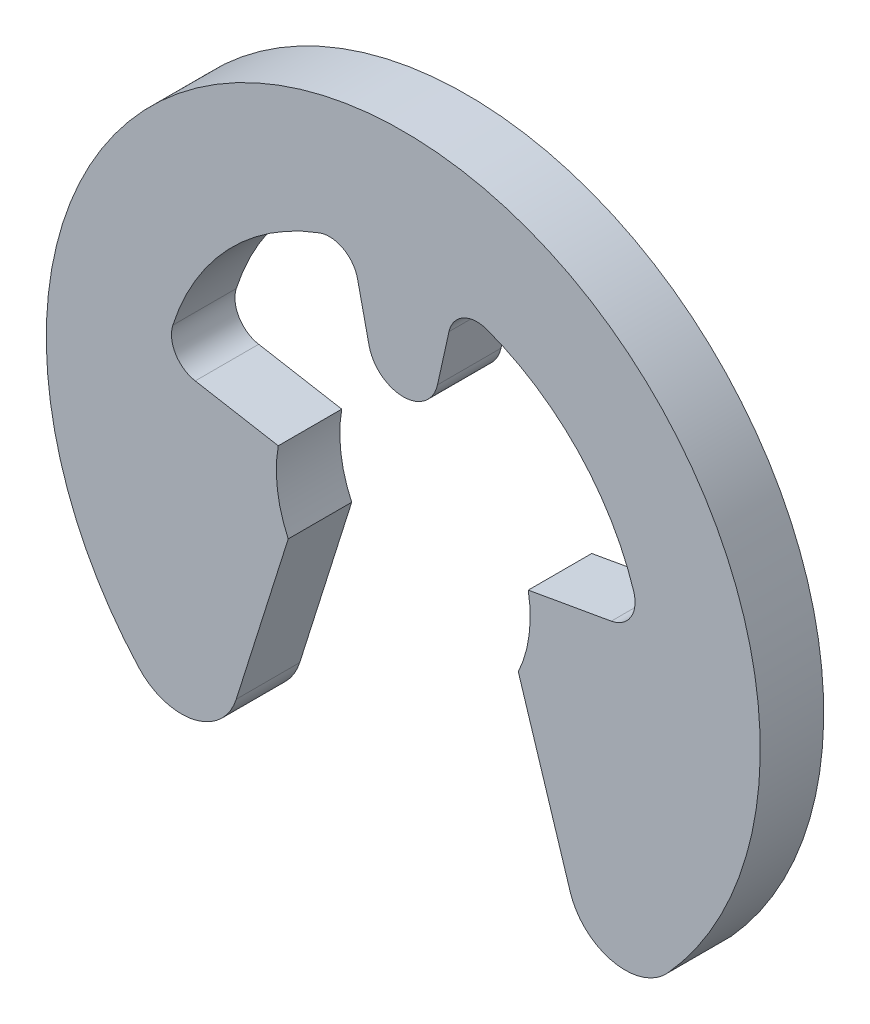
from build123d import *

# Parameters (mm, degrees)
BODY_DEPTH = 0.2


with BuildPart() as part:
    # BodySke → Body (new body)
    with BuildSketch(Plane.XY):
        with BuildLine():
            Line((0.393923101, 0.069459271), (0.655621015, 0.115603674))
            ThreePointArc((0.655621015, 0.115603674), (0.717463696, 0.158008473), (0.726194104, 0.23248306))
            ThreePointArc((0.726194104, 0.23248306), (0.550802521, 0.527278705), (0.26393793, 0.71536216))
            ThreePointArc((0.26393793, 0.71536216), (0.189153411, 0.709888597), (0.144091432, 0.649954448))
            Line((0.144091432, 0.649954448), (0.107871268, 0.486575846))
            ThreePointArc((0.107871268, 0.486575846), (0, 0.4), (-0.107871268, 0.486575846))
            Line((-0.107871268, 0.486575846), (-0.144091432, 0.649954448))
            ThreePointArc((-0.144091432, 0.649954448), (-0.189153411, 0.709888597), (-0.26393793, 0.71536216))
            ThreePointArc((-0.26393793, 0.71536216), (-0.550802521, 0.527278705), (-0.726194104, 0.23248306))
            ThreePointArc((-0.726194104, 0.23248306), (-0.717463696, 0.158008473), (-0.655621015, 0.115603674))
            Line((-0.655621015, 0.115603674), (-0.393923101, 0.069459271))
            ThreePointArc((-0.393923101, 0.069459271), (-0.396577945, -0.052210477), (-0.362523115, -0.169047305))
            Line((-0.362523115, -0.169047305), (-0.526283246, -0.688428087))
            ThreePointArc((-0.526283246, -0.688428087), (-0.660379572, -0.810981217), (-0.833417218, -0.755672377))
            ThreePointArc((-0.833417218, -0.755672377), (0, 1.125), (0.833417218, -0.755672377))
            ThreePointArc((0.833417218, -0.755672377), (0.660379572, -0.810981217), (0.526283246, -0.688428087))
            Line((0.526283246, -0.688428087), (0.362523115, -0.169047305))
            ThreePointArc((0.362523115, -0.169047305), (0.396577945, -0.052210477), (0.393923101, 0.069459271))
        make_face()
    extrude(amount=-BODY_DEPTH)


solid = part.part
